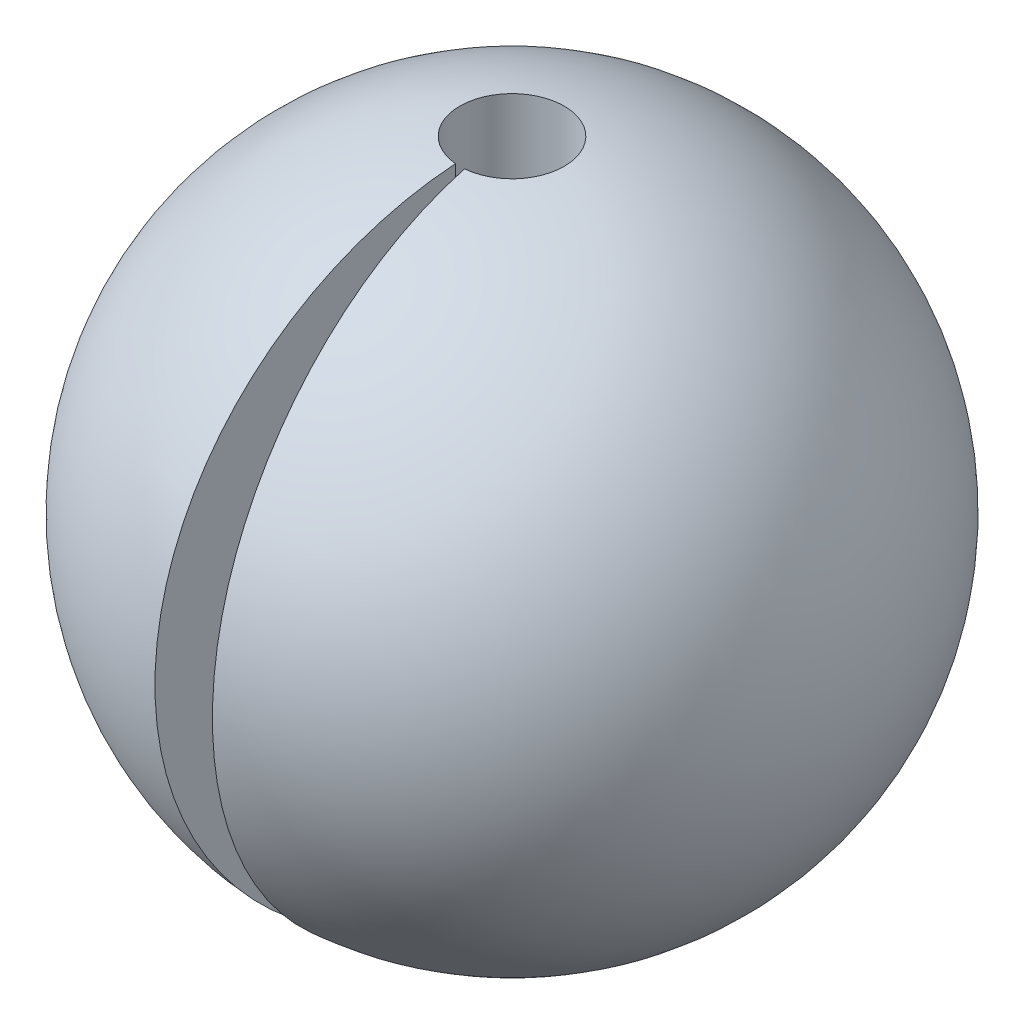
ISO-10303-21;
HEADER;
FILE_DESCRIPTION(('STEP AP214'),'2;1');
FILE_NAME('part.step','',(''),(''),'','','');
FILE_SCHEMA(('AUTOMOTIVE_DESIGN { 1 0 10303 214 1 1 1 1 }'));
ENDSEC;
DATA;
#1=APPLICATION_CONTEXT('core data for automotive mechanical design processes');
#2=APPLICATION_PROTOCOL_DEFINITION('international standard','automotive_design',2000,#1);
#3=PRODUCT_CONTEXT('',#1,'mechanical');
#4=PRODUCT('Part','Part','',(#3));
#5=PRODUCT_RELATED_PRODUCT_CATEGORY('part','',(#4));
#6=PRODUCT_DEFINITION_FORMATION('','',#4);
#7=PRODUCT_DEFINITION_CONTEXT('part definition',#1,'design');
#8=PRODUCT_DEFINITION('design','',#6,#7);
#9=PRODUCT_DEFINITION_SHAPE('','',#8);
#10=(LENGTH_UNIT() NAMED_UNIT(*) SI_UNIT(.MILLI.,.METRE.));
#11=(NAMED_UNIT(*) PLANE_ANGLE_UNIT() SI_UNIT($,.RADIAN.));
#12=(NAMED_UNIT(*) SI_UNIT($,.STERADIAN.) SOLID_ANGLE_UNIT());
#13=UNCERTAINTY_MEASURE_WITH_UNIT(LENGTH_MEASURE(1.E-05),#10,'distance_accuracy_value','');
#14=(GEOMETRIC_REPRESENTATION_CONTEXT(3) GLOBAL_UNCERTAINTY_ASSIGNED_CONTEXT((#13)) GLOBAL_UNIT_ASSIGNED_CONTEXT((#10,
#11,#12)) REPRESENTATION_CONTEXT('',''));
#15=CARTESIAN_POINT('',(0.,0.,0.));
#16=DIRECTION('',(0.,0.,1.));
#17=DIRECTION('',(1.,0.,0.));
#18=AXIS2_PLACEMENT_3D('',#15,#16,#17);
#19=CARTESIAN_POINT('',(0.,0.,0.));
#20=DIRECTION('',(0.,-1.,0.));
#21=DIRECTION('',(-1.,0.,0.));
#22=AXIS2_PLACEMENT_3D('',#19,#20,#21);
#23=SPHERICAL_SURFACE('',#22,1900.);
#24=CARTESIAN_POINT('',(0.,1876.00613005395,0.));
#25=DIRECTION('',(0.,-1.,0.));
#26=DIRECTION('',(0.,0.,-1.));
#27=AXIS2_PLACEMENT_3D('',#24,#25,#26);
#28=CIRCLE('',#27,301.);
#29=CARTESIAN_POINT('',(-26.233878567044,1876.00613005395,299.854604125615));
#30=VERTEX_POINT('',#29);
#31=CARTESIAN_POINT('',(26.2338785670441,1876.00613005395,299.854604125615));
#32=VERTEX_POINT('',#31);
#33=EDGE_CURVE('E67',#30,#32,#28,.T.);
#34=ORIENTED_EDGE('',*,*,#33,.T.);
#35=CARTESIAN_POINT('',(0.,0.,0.));
#36=DIRECTION('',(0.996194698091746,0.,-0.0871557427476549));
#37=DIRECTION('',(-0.0871557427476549,0.,-0.996194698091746));
#38=AXIS2_PLACEMENT_3D('',#35,#36,#37);
#39=CIRCLE('',#38,1900.);
#40=CARTESIAN_POINT('',(26.2338785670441,-1876.00613005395,299.854604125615));
#41=VERTEX_POINT('',#40);
#42=EDGE_CURVE('E55',#32,#41,#39,.T.);
#43=ORIENTED_EDGE('',*,*,#42,.T.);
#44=CARTESIAN_POINT('',(0.,-1876.00613005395,0.));
#45=DIRECTION('',(0.,-1.,0.));
#46=DIRECTION('',(0.,0.,-1.));
#47=AXIS2_PLACEMENT_3D('',#44,#45,#46);
#48=CIRCLE('',#47,301.);
#49=CARTESIAN_POINT('',(-26.233878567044,-1876.00613005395,299.854604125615));
#50=VERTEX_POINT('',#49);
#51=EDGE_CURVE('E64',#50,#41,#48,.T.);
#52=ORIENTED_EDGE('',*,*,#51,.F.);
#53=CARTESIAN_POINT('',(0.,0.,0.));
#54=DIRECTION('',(-0.996194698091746,0.,-0.0871557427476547));
#55=DIRECTION('',(-0.0871557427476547,0.,0.996194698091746));
#56=AXIS2_PLACEMENT_3D('',#53,#54,#55);
#57=CIRCLE('',#56,1900.);
#58=EDGE_CURVE('E48',#50,#30,#57,.T.);
#59=ORIENTED_EDGE('',*,*,#58,.T.);
#60=EDGE_LOOP('',(#34,#43,#52,#59));
#61=FACE_BOUND('',#60,.T.);
#62=ADVANCED_FACE('F35',(#61),#23,.T.);
#63=CARTESIAN_POINT('',(0.,0.,0.));
#64=DIRECTION('',(0.,-1.,0.));
#65=DIRECTION('',(0.,0.,-1.));
#66=AXIS2_PLACEMENT_3D('',#63,#64,#65);
#67=CYLINDRICAL_SURFACE('',#66,301.);
#68=ORIENTED_EDGE('',*,*,#51,.T.);
#69=DIRECTION('',(0.,-1.,0.));
#70=VECTOR('',#69,1.);
#71=CARTESIAN_POINT('',(26.2338785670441,0.,299.854604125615));
#72=LINE('',#71,#70);
#73=EDGE_CURVE('E11',#41,#32,#72,.F.);
#74=ORIENTED_EDGE('',*,*,#73,.T.);
#75=ORIENTED_EDGE('',*,*,#33,.F.);
#76=DIRECTION('',(0.,-1.,0.));
#77=VECTOR('',#76,1.);
#78=CARTESIAN_POINT('',(-26.233878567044,0.,299.854604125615));
#79=LINE('',#78,#77);
#80=EDGE_CURVE('E42',#30,#50,#79,.T.);
#81=ORIENTED_EDGE('',*,*,#80,.T.);
#82=EDGE_LOOP('',(#68,#74,#75,#81));
#83=FACE_BOUND('',#82,.T.);
#84=ADVANCED_FACE('F69',(#83),#67,.F.);
#85=CARTESIAN_POINT('',(0.,-1876.00613005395,0.));
#86=DIRECTION('',(-0.996194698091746,0.,-0.0871557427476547));
#87=DIRECTION('',(-0.0871557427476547,0.,0.996194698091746));
#88=AXIS2_PLACEMENT_3D('',#85,#86,#87);
#89=PLANE('',#88);
#90=ORIENTED_EDGE('',*,*,#80,.F.);
#91=ORIENTED_EDGE('',*,*,#58,.F.);
#92=EDGE_LOOP('',(#90,#91));
#93=FACE_BOUND('',#92,.T.);
#94=ADVANCED_FACE('F59',(#93),#89,.F.);
#95=CARTESIAN_POINT('',(204.578400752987,-1876.00613005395,2338.341820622));
#96=DIRECTION('',(0.996194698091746,0.,-0.0871557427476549));
#97=DIRECTION('',(-0.0871557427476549,0.,-0.996194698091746));
#98=AXIS2_PLACEMENT_3D('',#95,#96,#97);
#99=PLANE('',#98);
#100=ORIENTED_EDGE('',*,*,#73,.F.);
#101=ORIENTED_EDGE('',*,*,#42,.F.);
#102=EDGE_LOOP('',(#100,#101));
#103=FACE_BOUND('',#102,.T.);
#104=ADVANCED_FACE('F73',(#103),#99,.F.);
#105=CLOSED_SHELL('',(#62,#84,#94,#104));
#106=MANIFOLD_SOLID_BREP('B2',#105);
#107=ADVANCED_BREP_SHAPE_REPRESENTATION('',(#18,#106),#14);
#108=SHAPE_DEFINITION_REPRESENTATION(#9,#107);
ENDSEC;
END-ISO-10303-21;
